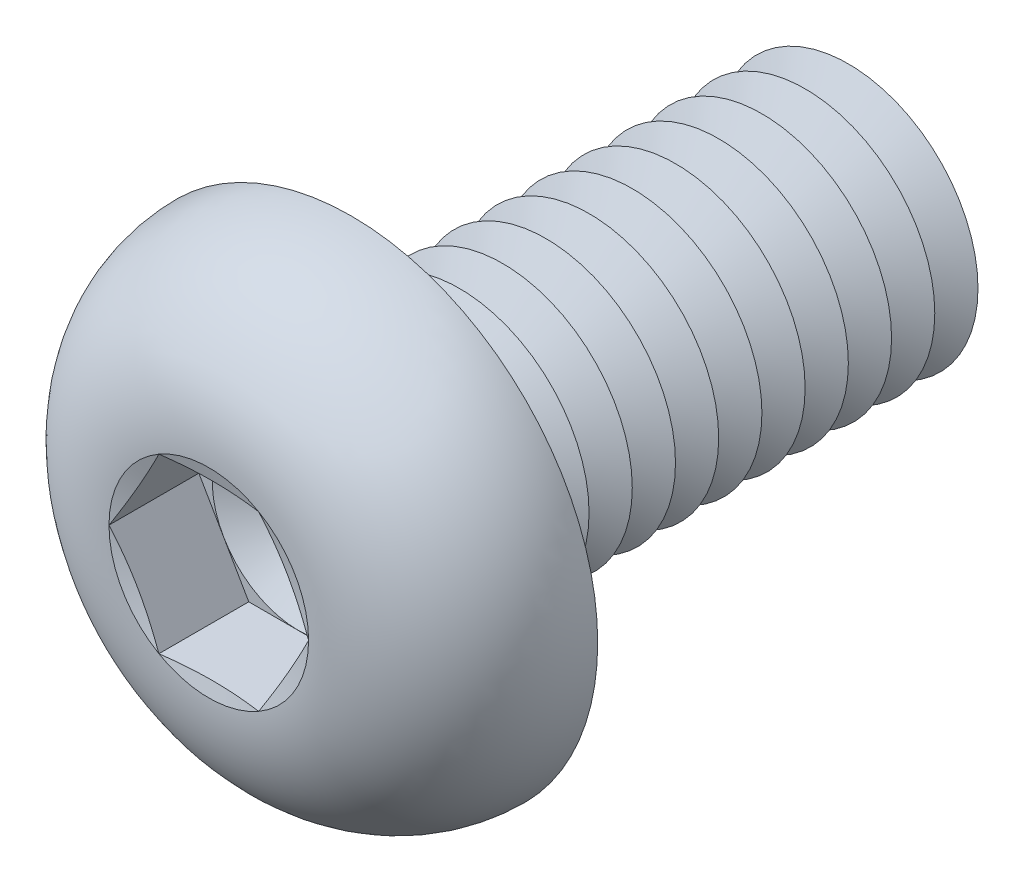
from build123d import *

# Parameters (mm, degrees)
FILLET1_R          = 0.25
LPATTERN1_COUNT    = 12
LPATTERN1_PITCH    = 0.5
CUT_EXTRUDE1_DEPTH = 1.04


with BuildPart() as part:
    # Sketch1 → Revolve1 (revolve)
    with BuildSketch(Plane(origin=(0, 0, 0), x_dir=(0, 0, -1), z_dir=(1, 0, 0)), mode=Mode.PRIVATE) as revolve1_sk:
        with BuildLine():
            Line((0, 1.5), (0, 2.85))
            ThreePointArc((0, 2.85), (-1.182850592, 2.35063849), (-1.65, 1.1547))
            Line((-1.65, 1.1547), (-1.495299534, 0.57735))
            Line((-1.495299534, 0.57735), (-1.65, 0.57735))
            Line((-1.65, 0.57735), (-1.65, 0))
            Line((-1.65, 0), (6, 0))
            Line((6, 0), (6, 1.5))
            Line((6, 1.5), (0, 1.5))
        make_face()
    revolve(revolve1_sk.sketch.rotate(Axis((0, 0, -6), (0, 0, 1)), 90), axis=Axis((0, 0, -6), (0, 0, 1)))

    # Fillet1
    fillet1_edges = [part.edges().sort_by_distance(p)[0] for p in [
        (1.5, 0, 0),
    ]]
    fillet(fillet1_edges, radius=FILLET1_R)

    # Sketch2 → Cut-Revolve1 (revolve, cut)
    with BuildSketch(Plane(origin=(0, 0, 0), x_dir=(0, 0, -1), z_dir=(1, 0, 0)), mode=Mode.PRIVATE) as cut_revolve1_sk:
        Polygon((5.75, 1.5), (6.25, 1.5), (6, 1.066987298), align=None)
    cut_revolve1 = revolve(cut_revolve1_sk.sketch.rotate(Axis((0, 0, -6), (0, 0, -1)), 270), axis=Axis((0, 0, -6), (0, 0, -1)), mode=Mode.SUBTRACT)

    # LPattern1: Cut-Revolve1 ×12
    with Locations(*[(0, 0, i * LPATTERN1_PITCH) for i in range(1, LPATTERN1_COUNT)]):
        add(cut_revolve1, mode=Mode.SUBTRACT)

    # Sketch3 → Cut-Extrude1 (cut)
    with BuildSketch(Plane.XY.offset(1.65)):
        Polygon((0.57735, 0.999999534), (-0.57735, 0.999999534), (-1.1547, 0), (-0.57735, -0.999999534), (0.57735, -0.999999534), (1.1547, 0), align=None)
    extrude(amount=-CUT_EXTRUDE1_DEPTH, mode=Mode.SUBTRACT)

    # Cut-Extrude2 cone 1 section (on through the dimple's axis) → Cut-Extrude2 (revolve, cut)
    with BuildSketch(Plane(origin=(0, 0, 0.61), x_dir=(0, -1, 0), z_dir=(1, 0, 0))):
        Polygon((0, 0), (0.999999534, 0), (0, 0.57735), align=None)
    revolve(axis=Axis((0, 0, 0.61), (0, 0, -1)), mode=Mode.SUBTRACT)


solid = part.part
